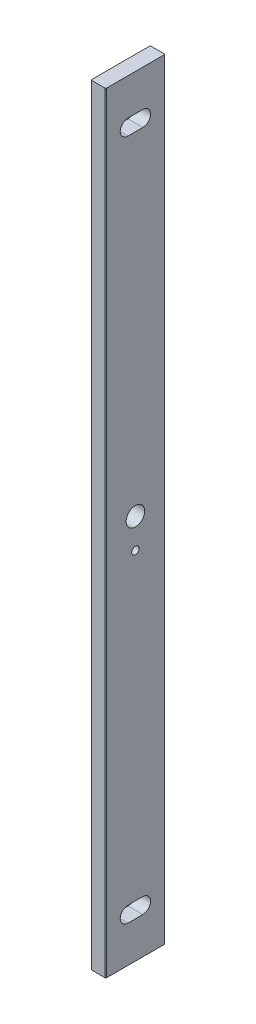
ISO-10303-21;
HEADER;
FILE_DESCRIPTION(('STEP AP214'),'2;1');
FILE_NAME('part.step','',(''),(''),'','','');
FILE_SCHEMA(('AUTOMOTIVE_DESIGN { 1 0 10303 214 1 1 1 1 }'));
ENDSEC;
DATA;
#1=APPLICATION_CONTEXT('core data for automotive mechanical design processes');
#2=APPLICATION_PROTOCOL_DEFINITION('international standard','automotive_design',2000,#1);
#3=PRODUCT_CONTEXT('',#1,'mechanical');
#4=PRODUCT('Part','Part','',(#3));
#5=PRODUCT_RELATED_PRODUCT_CATEGORY('part','',(#4));
#6=PRODUCT_DEFINITION_FORMATION('','',#4);
#7=PRODUCT_DEFINITION_CONTEXT('part definition',#1,'design');
#8=PRODUCT_DEFINITION('design','',#6,#7);
#9=PRODUCT_DEFINITION_SHAPE('','',#8);
#10=(LENGTH_UNIT() NAMED_UNIT(*) SI_UNIT(.MILLI.,.METRE.));
#11=(NAMED_UNIT(*) PLANE_ANGLE_UNIT() SI_UNIT($,.RADIAN.));
#12=(NAMED_UNIT(*) SI_UNIT($,.STERADIAN.) SOLID_ANGLE_UNIT());
#13=UNCERTAINTY_MEASURE_WITH_UNIT(LENGTH_MEASURE(1.E-05),#10,'distance_accuracy_value','');
#14=(GEOMETRIC_REPRESENTATION_CONTEXT(3) GLOBAL_UNCERTAINTY_ASSIGNED_CONTEXT((#13)) GLOBAL_UNIT_ASSIGNED_CONTEXT((#10,
#11,#12)) REPRESENTATION_CONTEXT('',''));
#15=CARTESIAN_POINT('',(0.,0.,0.));
#16=DIRECTION('',(0.,0.,1.));
#17=DIRECTION('',(1.,0.,0.));
#18=AXIS2_PLACEMENT_3D('',#15,#16,#17);
#19=CARTESIAN_POINT('',(5.,-260.,20.));
#20=DIRECTION('',(0.,0.,1.));
#21=DIRECTION('',(1.,0.,0.));
#22=AXIS2_PLACEMENT_3D('',#19,#20,#21);
#23=PLANE('',#22);
#24=DIRECTION('',(-1.,0.,0.));
#25=VECTOR('',#24,1.);
#26=CARTESIAN_POINT('',(5.,-260.,20.));
#27=LINE('',#26,#25);
#28=CARTESIAN_POINT('',(4.5,-260.,20.));
#29=VERTEX_POINT('',#28);
#30=CARTESIAN_POINT('',(-4.5,-260.,20.));
#31=VERTEX_POINT('',#30);
#32=EDGE_CURVE('E238',#29,#31,#27,.T.);
#33=ORIENTED_EDGE('',*,*,#32,.F.);
#34=DIRECTION('',(0.,1.,0.));
#35=VECTOR('',#34,1.);
#36=CARTESIAN_POINT('',(4.5,260.,20.));
#37=LINE('',#36,#35);
#38=CARTESIAN_POINT('',(4.5,260.,20.));
#39=VERTEX_POINT('',#38);
#40=EDGE_CURVE('E250',#29,#39,#37,.T.);
#41=ORIENTED_EDGE('',*,*,#40,.T.);
#42=DIRECTION('',(-1.,0.,0.));
#43=VECTOR('',#42,1.);
#44=CARTESIAN_POINT('',(5.,260.,20.));
#45=LINE('',#44,#43);
#46=CARTESIAN_POINT('',(-4.5,260.,20.));
#47=VERTEX_POINT('',#46);
#48=EDGE_CURVE('E233',#39,#47,#45,.T.);
#49=ORIENTED_EDGE('',*,*,#48,.T.);
#50=DIRECTION('',(0.,1.,0.));
#51=VECTOR('',#50,1.);
#52=CARTESIAN_POINT('',(-4.5,-260.,20.));
#53=LINE('',#52,#51);
#54=EDGE_CURVE('E241',#47,#31,#53,.F.);
#55=ORIENTED_EDGE('',*,*,#54,.T.);
#56=EDGE_LOOP('',(#33,#41,#49,#55));
#57=FACE_BOUND('',#56,.T.);
#58=ADVANCED_FACE('F32',(#57),#23,.T.);
#59=CARTESIAN_POINT('',(5.,-260.,-20.));
#60=DIRECTION('',(0.,-1.,0.));
#61=DIRECTION('',(0.,0.,-1.));
#62=AXIS2_PLACEMENT_3D('',#59,#60,#61);
#63=PLANE('',#62);
#64=DIRECTION('',(0.,0.,1.));
#65=VECTOR('',#64,1.);
#66=CARTESIAN_POINT('',(5.,-260.,-20.));
#67=LINE('',#66,#65);
#68=CARTESIAN_POINT('',(5.,-260.,-19.5));
#69=VERTEX_POINT('',#68);
#70=CARTESIAN_POINT('',(5.,-260.,19.5));
#71=VERTEX_POINT('',#70);
#72=EDGE_CURVE('E229',#69,#71,#67,.T.);
#73=ORIENTED_EDGE('',*,*,#72,.T.);
#74=CARTESIAN_POINT('',(4.5,-260.,19.5));
#75=DIRECTION('',(0.,-1.,0.));
#76=DIRECTION('',(0.,0.,-1.));
#77=AXIS2_PLACEMENT_3D('',#74,#75,#76);
#78=CIRCLE('',#77,0.5);
#79=EDGE_CURVE('E269',#71,#29,#78,.T.);
#80=ORIENTED_EDGE('',*,*,#79,.T.);
#81=ORIENTED_EDGE('',*,*,#32,.T.);
#82=CARTESIAN_POINT('',(-4.5,-260.,19.5));
#83=DIRECTION('',(0.,-1.,0.));
#84=DIRECTION('',(0.,0.,-1.));
#85=AXIS2_PLACEMENT_3D('',#82,#83,#84);
#86=CIRCLE('',#85,0.5);
#87=CARTESIAN_POINT('',(-5.,-260.,19.5));
#88=VERTEX_POINT('',#87);
#89=EDGE_CURVE('E266',#31,#88,#86,.T.);
#90=ORIENTED_EDGE('',*,*,#89,.T.);
#91=DIRECTION('',(0.,0.,1.));
#92=VECTOR('',#91,1.);
#93=CARTESIAN_POINT('',(-5.,-260.,-20.));
#94=LINE('',#93,#92);
#95=CARTESIAN_POINT('',(-5.,-260.,-19.5));
#96=VERTEX_POINT('',#95);
#97=EDGE_CURVE('E230',#96,#88,#94,.T.);
#98=ORIENTED_EDGE('',*,*,#97,.F.);
#99=CARTESIAN_POINT('',(-4.5,-260.,-19.5));
#100=DIRECTION('',(0.,-1.,0.));
#101=DIRECTION('',(0.,0.,-1.));
#102=AXIS2_PLACEMENT_3D('',#99,#100,#101);
#103=CIRCLE('',#102,0.5);
#104=CARTESIAN_POINT('',(-4.5,-260.,-20.));
#105=VERTEX_POINT('',#104);
#106=EDGE_CURVE('E47',#96,#105,#103,.T.);
#107=ORIENTED_EDGE('',*,*,#106,.T.);
#108=DIRECTION('',(-1.,0.,0.));
#109=VECTOR('',#108,1.);
#110=CARTESIAN_POINT('',(5.,-260.,-20.));
#111=LINE('',#110,#109);
#112=CARTESIAN_POINT('',(4.5,-260.,-20.));
#113=VERTEX_POINT('',#112);
#114=EDGE_CURVE('E242',#113,#105,#111,.T.);
#115=ORIENTED_EDGE('',*,*,#114,.F.);
#116=CARTESIAN_POINT('',(4.5,-260.,-19.5));
#117=DIRECTION('',(0.,-1.,0.));
#118=DIRECTION('',(0.,0.,-1.));
#119=AXIS2_PLACEMENT_3D('',#116,#117,#118);
#120=CIRCLE('',#119,0.5);
#121=EDGE_CURVE('E55',#113,#69,#120,.T.);
#122=ORIENTED_EDGE('',*,*,#121,.T.);
#123=EDGE_LOOP('',(#73,#80,#81,#90,#98,#107,#115,#122));
#124=FACE_BOUND('',#123,.T.);
#125=ADVANCED_FACE('F281',(#124),#63,.T.);
#126=CARTESIAN_POINT('',(5.,260.,-20.));
#127=DIRECTION('',(0.,0.,-1.));
#128=DIRECTION('',(-1.,0.,0.));
#129=AXIS2_PLACEMENT_3D('',#126,#127,#128);
#130=PLANE('',#129);
#131=DIRECTION('',(-1.,0.,0.));
#132=VECTOR('',#131,1.);
#133=CARTESIAN_POINT('',(5.,260.,-20.));
#134=LINE('',#133,#132);
#135=CARTESIAN_POINT('',(4.5,260.,-20.));
#136=VERTEX_POINT('',#135);
#137=CARTESIAN_POINT('',(-4.5,260.,-20.));
#138=VERTEX_POINT('',#137);
#139=EDGE_CURVE('E244',#136,#138,#134,.T.);
#140=ORIENTED_EDGE('',*,*,#139,.F.);
#141=DIRECTION('',(0.,-1.,0.));
#142=VECTOR('',#141,1.);
#143=CARTESIAN_POINT('',(4.5,-260.,-20.));
#144=LINE('',#143,#142);
#145=EDGE_CURVE('E273',#136,#113,#144,.T.);
#146=ORIENTED_EDGE('',*,*,#145,.T.);
#147=ORIENTED_EDGE('',*,*,#114,.T.);
#148=DIRECTION('',(0.,-1.,0.));
#149=VECTOR('',#148,1.);
#150=CARTESIAN_POINT('',(-4.5,260.,-20.));
#151=LINE('',#150,#149);
#152=EDGE_CURVE('E271',#105,#138,#151,.F.);
#153=ORIENTED_EDGE('',*,*,#152,.T.);
#154=EDGE_LOOP('',(#140,#146,#147,#153));
#155=FACE_BOUND('',#154,.T.);
#156=ADVANCED_FACE('F293',(#155),#130,.T.);
#157=CARTESIAN_POINT('',(5.,260.,20.));
#158=DIRECTION('',(0.,1.,0.));
#159=DIRECTION('',(0.,0.,1.));
#160=AXIS2_PLACEMENT_3D('',#157,#158,#159);
#161=PLANE('',#160);
#162=ORIENTED_EDGE('',*,*,#48,.F.);
#163=CARTESIAN_POINT('',(4.5,260.,19.5));
#164=DIRECTION('',(0.,1.,0.));
#165=DIRECTION('',(0.,0.,1.));
#166=AXIS2_PLACEMENT_3D('',#163,#164,#165);
#167=CIRCLE('',#166,0.5);
#168=CARTESIAN_POINT('',(5.,260.,19.5));
#169=VERTEX_POINT('',#168);
#170=EDGE_CURVE('E259',#39,#169,#167,.T.);
#171=ORIENTED_EDGE('',*,*,#170,.T.);
#172=DIRECTION('',(0.,0.,-1.));
#173=VECTOR('',#172,1.);
#174=CARTESIAN_POINT('',(5.,260.,20.));
#175=LINE('',#174,#173);
#176=CARTESIAN_POINT('',(5.,260.,-19.5));
#177=VERTEX_POINT('',#176);
#178=EDGE_CURVE('E226',#169,#177,#175,.T.);
#179=ORIENTED_EDGE('',*,*,#178,.T.);
#180=CARTESIAN_POINT('',(4.5,260.,-19.5));
#181=DIRECTION('',(0.,1.,0.));
#182=DIRECTION('',(0.,0.,1.));
#183=AXIS2_PLACEMENT_3D('',#180,#181,#182);
#184=CIRCLE('',#183,0.5);
#185=EDGE_CURVE('E257',#177,#136,#184,.T.);
#186=ORIENTED_EDGE('',*,*,#185,.T.);
#187=ORIENTED_EDGE('',*,*,#139,.T.);
#188=CARTESIAN_POINT('',(-4.5,260.,-19.5));
#189=DIRECTION('',(0.,1.,0.));
#190=DIRECTION('',(0.,0.,1.));
#191=AXIS2_PLACEMENT_3D('',#188,#189,#190);
#192=CIRCLE('',#191,0.5);
#193=CARTESIAN_POINT('',(-5.,260.,-19.5));
#194=VERTEX_POINT('',#193);
#195=EDGE_CURVE('E253',#138,#194,#192,.T.);
#196=ORIENTED_EDGE('',*,*,#195,.T.);
#197=DIRECTION('',(0.,0.,-1.));
#198=VECTOR('',#197,1.);
#199=CARTESIAN_POINT('',(-5.,260.,20.));
#200=LINE('',#199,#198);
#201=CARTESIAN_POINT('',(-5.,260.,19.5));
#202=VERTEX_POINT('',#201);
#203=EDGE_CURVE('E219',#202,#194,#200,.T.);
#204=ORIENTED_EDGE('',*,*,#203,.F.);
#205=CARTESIAN_POINT('',(-4.5,260.,19.5));
#206=DIRECTION('',(0.,1.,0.));
#207=DIRECTION('',(0.,0.,1.));
#208=AXIS2_PLACEMENT_3D('',#205,#206,#207);
#209=CIRCLE('',#208,0.5);
#210=EDGE_CURVE('E255',#202,#47,#209,.T.);
#211=ORIENTED_EDGE('',*,*,#210,.T.);
#212=EDGE_LOOP('',(#162,#171,#179,#186,#187,#196,#204,#211));
#213=FACE_BOUND('',#212,.T.);
#214=ADVANCED_FACE('F289',(#213),#161,.T.);
#215=CARTESIAN_POINT('',(5.,0.,0.));
#216=DIRECTION('',(-1.,0.,0.));
#217=DIRECTION('',(0.,0.,1.));
#218=AXIS2_PLACEMENT_3D('',#215,#216,#217);
#219=PLANE('',#218);
#220=CARTESIAN_POINT('',(5.,0.,0.));
#221=DIRECTION('',(1.,0.,0.));
#222=DIRECTION('',(0.,0.,-1.));
#223=AXIS2_PLACEMENT_3D('',#220,#221,#222);
#224=CIRCLE('',#223,6.24999999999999);
#225=CARTESIAN_POINT('',(5.,0.,-6.24999999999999));
#226=VERTEX_POINT('',#225);
#227=EDGE_CURVE('E503',#226,#226,#224,.T.);
#228=ORIENTED_EDGE('',*,*,#227,.F.);
#229=EDGE_LOOP('',(#228));
#230=FACE_BOUND('',#229,.T.);
#231=CARTESIAN_POINT('',(5.,-20.,0.));
#232=DIRECTION('',(1.,0.,0.));
#233=DIRECTION('',(0.,0.,-1.));
#234=AXIS2_PLACEMENT_3D('',#231,#232,#233);
#235=CIRCLE('',#234,2.49999999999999);
#236=CARTESIAN_POINT('',(5.,-20.,-2.49999999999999));
#237=VERTEX_POINT('',#236);
#238=EDGE_CURVE('E499',#237,#237,#235,.T.);
#239=ORIENTED_EDGE('',*,*,#238,.F.);
#240=EDGE_LOOP('',(#239));
#241=FACE_BOUND('',#240,.T.);
#242=DIRECTION('',(0.,0.,-1.));
#243=VECTOR('',#242,1.);
#244=CARTESIAN_POINT('',(5.,-235.25,5.));
#245=LINE('',#244,#243);
#246=CARTESIAN_POINT('',(5.,-235.25,5.));
#247=VERTEX_POINT('',#246);
#248=CARTESIAN_POINT('',(5.,-235.25,-5.));
#249=VERTEX_POINT('',#248);
#250=EDGE_CURVE('E184',#247,#249,#245,.T.);
#251=ORIENTED_EDGE('',*,*,#250,.F.);
#252=CARTESIAN_POINT('',(5.,-230.,5.));
#253=DIRECTION('',(1.,0.,0.));
#254=DIRECTION('',(0.,0.,-1.));
#255=AXIS2_PLACEMENT_3D('',#252,#253,#254);
#256=CIRCLE('',#255,5.25);
#257=CARTESIAN_POINT('',(5.,-224.75,5.));
#258=VERTEX_POINT('',#257);
#259=EDGE_CURVE('E154',#258,#247,#256,.T.);
#260=ORIENTED_EDGE('',*,*,#259,.F.);
#261=DIRECTION('',(0.,0.,1.));
#262=VECTOR('',#261,1.);
#263=CARTESIAN_POINT('',(5.,-224.75,-5.));
#264=LINE('',#263,#262);
#265=CARTESIAN_POINT('',(5.,-224.75,-5.));
#266=VERTEX_POINT('',#265);
#267=EDGE_CURVE('E172',#266,#258,#264,.T.);
#268=ORIENTED_EDGE('',*,*,#267,.F.);
#269=CARTESIAN_POINT('',(5.,-230.,-5.));
#270=DIRECTION('',(1.,0.,0.));
#271=DIRECTION('',(0.,0.,-1.));
#272=AXIS2_PLACEMENT_3D('',#269,#270,#271);
#273=CIRCLE('',#272,5.25);
#274=EDGE_CURVE('E175',#249,#266,#273,.T.);
#275=ORIENTED_EDGE('',*,*,#274,.F.);
#276=EDGE_LOOP('',(#251,#260,#268,#275));
#277=FACE_BOUND('',#276,.T.);
#278=DIRECTION('',(0.,0.,1.));
#279=VECTOR('',#278,1.);
#280=CARTESIAN_POINT('',(5.,224.75,-5.));
#281=LINE('',#280,#279);
#282=CARTESIAN_POINT('',(5.,224.75,-5.));
#283=VERTEX_POINT('',#282);
#284=CARTESIAN_POINT('',(5.,224.75,5.));
#285=VERTEX_POINT('',#284);
#286=EDGE_CURVE('E204',#283,#285,#281,.T.);
#287=ORIENTED_EDGE('',*,*,#286,.T.);
#288=CARTESIAN_POINT('',(5.,230.,5.));
#289=DIRECTION('',(-1.,0.,0.));
#290=DIRECTION('',(0.,0.,1.));
#291=AXIS2_PLACEMENT_3D('',#288,#289,#290);
#292=CIRCLE('',#291,5.25);
#293=CARTESIAN_POINT('',(5.,235.25,5.));
#294=VERTEX_POINT('',#293);
#295=EDGE_CURVE('E194',#285,#294,#292,.T.);
#296=ORIENTED_EDGE('',*,*,#295,.T.);
#297=DIRECTION('',(0.,0.,-1.));
#298=VECTOR('',#297,1.);
#299=CARTESIAN_POINT('',(5.,235.25,5.));
#300=LINE('',#299,#298);
#301=CARTESIAN_POINT('',(5.,235.25,-5.));
#302=VERTEX_POINT('',#301);
#303=EDGE_CURVE('E197',#294,#302,#300,.T.);
#304=ORIENTED_EDGE('',*,*,#303,.T.);
#305=CARTESIAN_POINT('',(5.,230.,-5.));
#306=DIRECTION('',(-1.,0.,0.));
#307=DIRECTION('',(0.,0.,1.));
#308=AXIS2_PLACEMENT_3D('',#305,#306,#307);
#309=CIRCLE('',#308,5.25);
#310=EDGE_CURVE('E201',#302,#283,#309,.T.);
#311=ORIENTED_EDGE('',*,*,#310,.T.);
#312=EDGE_LOOP('',(#287,#296,#304,#311));
#313=FACE_BOUND('',#312,.T.);
#314=ORIENTED_EDGE('',*,*,#178,.F.);
#315=DIRECTION('',(0.,1.,0.));
#316=VECTOR('',#315,1.);
#317=CARTESIAN_POINT('',(5.,-260.,19.5));
#318=LINE('',#317,#316);
#319=EDGE_CURVE('E263',#169,#71,#318,.F.);
#320=ORIENTED_EDGE('',*,*,#319,.T.);
#321=ORIENTED_EDGE('',*,*,#72,.F.);
#322=DIRECTION('',(0.,-1.,0.));
#323=VECTOR('',#322,1.);
#324=CARTESIAN_POINT('',(5.,260.,-19.5));
#325=LINE('',#324,#323);
#326=EDGE_CURVE('E261',#69,#177,#325,.F.);
#327=ORIENTED_EDGE('',*,*,#326,.T.);
#328=EDGE_LOOP('',(#314,#320,#321,#327));
#329=FACE_BOUND('',#328,.T.);
#330=ADVANCED_FACE('F298',(#230,#241,#277,#313,#329),#219,.F.);
#331=CARTESIAN_POINT('',(-5.,0.,0.));
#332=DIRECTION('',(-1.,0.,0.));
#333=DIRECTION('',(0.,0.,1.));
#334=AXIS2_PLACEMENT_3D('',#331,#332,#333);
#335=PLANE('',#334);
#336=CARTESIAN_POINT('',(-4.99999999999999,0.,0.));
#337=DIRECTION('',(1.,0.,0.));
#338=DIRECTION('',(0.,0.,-1.));
#339=AXIS2_PLACEMENT_3D('',#336,#337,#338);
#340=CIRCLE('',#339,6.24999999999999);
#341=CARTESIAN_POINT('',(-4.99999999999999,0.,-6.24999999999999));
#342=VERTEX_POINT('',#341);
#343=EDGE_CURVE('E501',#342,#342,#340,.T.);
#344=ORIENTED_EDGE('',*,*,#343,.T.);
#345=EDGE_LOOP('',(#344));
#346=FACE_BOUND('',#345,.T.);
#347=CARTESIAN_POINT('',(-4.99999999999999,-20.,0.));
#348=DIRECTION('',(1.,0.,0.));
#349=DIRECTION('',(0.,0.,-1.));
#350=AXIS2_PLACEMENT_3D('',#347,#348,#349);
#351=CIRCLE('',#350,2.49999999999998);
#352=CARTESIAN_POINT('',(-4.99999999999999,-20.,-2.49999999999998));
#353=VERTEX_POINT('',#352);
#354=EDGE_CURVE('E178',#353,#353,#351,.T.);
#355=ORIENTED_EDGE('',*,*,#354,.T.);
#356=EDGE_LOOP('',(#355));
#357=FACE_BOUND('',#356,.T.);
#358=CARTESIAN_POINT('',(-5.,-230.,5.));
#359=DIRECTION('',(1.,0.,0.));
#360=DIRECTION('',(0.,0.,-1.));
#361=AXIS2_PLACEMENT_3D('',#358,#359,#360);
#362=CIRCLE('',#361,5.25);
#363=CARTESIAN_POINT('',(-5.,-224.75,5.));
#364=VERTEX_POINT('',#363);
#365=CARTESIAN_POINT('',(-5.,-235.25,5.));
#366=VERTEX_POINT('',#365);
#367=EDGE_CURVE('E151',#364,#366,#362,.T.);
#368=ORIENTED_EDGE('',*,*,#367,.T.);
#369=DIRECTION('',(0.,0.,-1.));
#370=VECTOR('',#369,1.);
#371=CARTESIAN_POINT('',(-5.,-235.25,5.));
#372=LINE('',#371,#370);
#373=CARTESIAN_POINT('',(-5.,-235.25,-5.));
#374=VERTEX_POINT('',#373);
#375=EDGE_CURVE('E163',#366,#374,#372,.T.);
#376=ORIENTED_EDGE('',*,*,#375,.T.);
#377=CARTESIAN_POINT('',(-5.,-230.,-5.));
#378=DIRECTION('',(1.,0.,0.));
#379=DIRECTION('',(0.,0.,-1.));
#380=AXIS2_PLACEMENT_3D('',#377,#378,#379);
#381=CIRCLE('',#380,5.25);
#382=CARTESIAN_POINT('',(-5.,-224.75,-5.));
#383=VERTEX_POINT('',#382);
#384=EDGE_CURVE('E167',#374,#383,#381,.T.);
#385=ORIENTED_EDGE('',*,*,#384,.T.);
#386=DIRECTION('',(0.,0.,1.));
#387=VECTOR('',#386,1.);
#388=CARTESIAN_POINT('',(-5.,-224.75,-5.));
#389=LINE('',#388,#387);
#390=EDGE_CURVE('E159',#383,#364,#389,.T.);
#391=ORIENTED_EDGE('',*,*,#390,.T.);
#392=EDGE_LOOP('',(#368,#376,#385,#391));
#393=FACE_BOUND('',#392,.T.);
#394=CARTESIAN_POINT('',(-5.,230.,5.));
#395=DIRECTION('',(-1.,0.,0.));
#396=DIRECTION('',(0.,0.,1.));
#397=AXIS2_PLACEMENT_3D('',#394,#395,#396);
#398=CIRCLE('',#397,5.25);
#399=CARTESIAN_POINT('',(-5.,224.75,5.));
#400=VERTEX_POINT('',#399);
#401=CARTESIAN_POINT('',(-5.,235.25,5.));
#402=VERTEX_POINT('',#401);
#403=EDGE_CURVE('E190',#400,#402,#398,.T.);
#404=ORIENTED_EDGE('',*,*,#403,.F.);
#405=DIRECTION('',(0.,0.,1.));
#406=VECTOR('',#405,1.);
#407=CARTESIAN_POINT('',(-5.,224.75,-5.));
#408=LINE('',#407,#406);
#409=CARTESIAN_POINT('',(-5.,224.75,-5.));
#410=VERTEX_POINT('',#409);
#411=EDGE_CURVE('E198',#410,#400,#408,.T.);
#412=ORIENTED_EDGE('',*,*,#411,.F.);
#413=CARTESIAN_POINT('',(-5.,230.,-5.));
#414=DIRECTION('',(-1.,0.,0.));
#415=DIRECTION('',(0.,0.,1.));
#416=AXIS2_PLACEMENT_3D('',#413,#414,#415);
#417=CIRCLE('',#416,5.25);
#418=CARTESIAN_POINT('',(-5.,235.25,-5.));
#419=VERTEX_POINT('',#418);
#420=EDGE_CURVE('E212',#419,#410,#417,.T.);
#421=ORIENTED_EDGE('',*,*,#420,.F.);
#422=DIRECTION('',(0.,0.,-1.));
#423=VECTOR('',#422,1.);
#424=CARTESIAN_POINT('',(-5.,235.25,5.));
#425=LINE('',#424,#423);
#426=EDGE_CURVE('E209',#402,#419,#425,.T.);
#427=ORIENTED_EDGE('',*,*,#426,.F.);
#428=EDGE_LOOP('',(#404,#412,#421,#427));
#429=FACE_BOUND('',#428,.T.);
#430=ORIENTED_EDGE('',*,*,#97,.T.);
#431=DIRECTION('',(0.,1.,0.));
#432=VECTOR('',#431,1.);
#433=CARTESIAN_POINT('',(-5.,0.,19.5));
#434=LINE('',#433,#432);
#435=EDGE_CURVE('E11',#88,#202,#434,.T.);
#436=ORIENTED_EDGE('',*,*,#435,.T.);
#437=ORIENTED_EDGE('',*,*,#203,.T.);
#438=DIRECTION('',(0.,-1.,0.));
#439=VECTOR('',#438,1.);
#440=CARTESIAN_POINT('',(-5.,0.,-19.5));
#441=LINE('',#440,#439);
#442=EDGE_CURVE('E40',#194,#96,#441,.T.);
#443=ORIENTED_EDGE('',*,*,#442,.T.);
#444=EDGE_LOOP('',(#430,#436,#437,#443));
#445=FACE_BOUND('',#444,.T.);
#446=ADVANCED_FACE('F169',(#346,#357,#393,#429,#445),#335,.T.);
#447=CARTESIAN_POINT('',(5.,230.,5.));
#448=DIRECTION('',(-1.,0.,0.));
#449=DIRECTION('',(0.,0.,1.));
#450=AXIS2_PLACEMENT_3D('',#447,#448,#449);
#451=CYLINDRICAL_SURFACE('',#450,5.25);
#452=ORIENTED_EDGE('',*,*,#403,.T.);
#453=DIRECTION('',(-1.,0.,0.));
#454=VECTOR('',#453,1.);
#455=CARTESIAN_POINT('',(5.,235.25,5.));
#456=LINE('',#455,#454);
#457=EDGE_CURVE('E207',#294,#402,#456,.T.);
#458=ORIENTED_EDGE('',*,*,#457,.F.);
#459=ORIENTED_EDGE('',*,*,#295,.F.);
#460=DIRECTION('',(-1.,0.,0.));
#461=VECTOR('',#460,1.);
#462=CARTESIAN_POINT('',(5.,224.75,5.));
#463=LINE('',#462,#461);
#464=EDGE_CURVE('E217',#285,#400,#463,.T.);
#465=ORIENTED_EDGE('',*,*,#464,.T.);
#466=EDGE_LOOP('',(#452,#458,#459,#465));
#467=FACE_BOUND('',#466,.T.);
#468=ADVANCED_FACE('F352',(#467),#451,.F.);
#469=CARTESIAN_POINT('',(5.,224.75,-5.));
#470=DIRECTION('',(0.,-1.,0.));
#471=DIRECTION('',(0.,0.,-1.));
#472=AXIS2_PLACEMENT_3D('',#469,#470,#471);
#473=PLANE('',#472);
#474=ORIENTED_EDGE('',*,*,#411,.T.);
#475=ORIENTED_EDGE('',*,*,#464,.F.);
#476=ORIENTED_EDGE('',*,*,#286,.F.);
#477=DIRECTION('',(-1.,0.,0.));
#478=VECTOR('',#477,1.);
#479=CARTESIAN_POINT('',(5.,224.75,-5.));
#480=LINE('',#479,#478);
#481=EDGE_CURVE('E220',#283,#410,#480,.T.);
#482=ORIENTED_EDGE('',*,*,#481,.T.);
#483=EDGE_LOOP('',(#474,#475,#476,#482));
#484=FACE_BOUND('',#483,.T.);
#485=ADVANCED_FACE('F461',(#484),#473,.F.);
#486=CARTESIAN_POINT('',(5.,230.,-5.));
#487=DIRECTION('',(-1.,0.,0.));
#488=DIRECTION('',(0.,0.,1.));
#489=AXIS2_PLACEMENT_3D('',#486,#487,#488);
#490=CYLINDRICAL_SURFACE('',#489,5.25);
#491=ORIENTED_EDGE('',*,*,#420,.T.);
#492=ORIENTED_EDGE('',*,*,#481,.F.);
#493=ORIENTED_EDGE('',*,*,#310,.F.);
#494=DIRECTION('',(-1.,0.,0.));
#495=VECTOR('',#494,1.);
#496=CARTESIAN_POINT('',(5.,235.25,-5.));
#497=LINE('',#496,#495);
#498=EDGE_CURVE('E222',#302,#419,#497,.T.);
#499=ORIENTED_EDGE('',*,*,#498,.T.);
#500=EDGE_LOOP('',(#491,#492,#493,#499));
#501=FACE_BOUND('',#500,.T.);
#502=ADVANCED_FACE('F451',(#501),#490,.F.);
#503=CARTESIAN_POINT('',(5.,235.25,5.));
#504=DIRECTION('',(0.,1.,0.));
#505=DIRECTION('',(0.,0.,1.));
#506=AXIS2_PLACEMENT_3D('',#503,#504,#505);
#507=PLANE('',#506);
#508=ORIENTED_EDGE('',*,*,#426,.T.);
#509=ORIENTED_EDGE('',*,*,#498,.F.);
#510=ORIENTED_EDGE('',*,*,#303,.F.);
#511=ORIENTED_EDGE('',*,*,#457,.T.);
#512=EDGE_LOOP('',(#508,#509,#510,#511));
#513=FACE_BOUND('',#512,.T.);
#514=ADVANCED_FACE('F442',(#513),#507,.F.);
#515=CARTESIAN_POINT('',(-5.,-230.,5.));
#516=DIRECTION('',(1.,0.,0.));
#517=DIRECTION('',(0.,0.,-1.));
#518=AXIS2_PLACEMENT_3D('',#515,#516,#517);
#519=CYLINDRICAL_SURFACE('',#518,5.25);
#520=ORIENTED_EDGE('',*,*,#259,.T.);
#521=DIRECTION('',(1.,0.,0.));
#522=VECTOR('',#521,1.);
#523=CARTESIAN_POINT('',(-5.,-235.25,5.));
#524=LINE('',#523,#522);
#525=EDGE_CURVE('E147',#366,#247,#524,.T.);
#526=ORIENTED_EDGE('',*,*,#525,.F.);
#527=ORIENTED_EDGE('',*,*,#367,.F.);
#528=DIRECTION('',(1.,0.,0.));
#529=VECTOR('',#528,1.);
#530=CARTESIAN_POINT('',(-5.,-224.75,5.));
#531=LINE('',#530,#529);
#532=EDGE_CURVE('E188',#364,#258,#531,.T.);
#533=ORIENTED_EDGE('',*,*,#532,.T.);
#534=EDGE_LOOP('',(#520,#526,#527,#533));
#535=FACE_BOUND('',#534,.T.);
#536=ADVANCED_FACE('F149',(#535),#519,.F.);
#537=CARTESIAN_POINT('',(-5.,-224.75,-5.));
#538=DIRECTION('',(0.,1.,0.));
#539=DIRECTION('',(0.,0.,1.));
#540=AXIS2_PLACEMENT_3D('',#537,#538,#539);
#541=PLANE('',#540);
#542=ORIENTED_EDGE('',*,*,#267,.T.);
#543=ORIENTED_EDGE('',*,*,#532,.F.);
#544=ORIENTED_EDGE('',*,*,#390,.F.);
#545=DIRECTION('',(1.,0.,0.));
#546=VECTOR('',#545,1.);
#547=CARTESIAN_POINT('',(-5.,-224.75,-5.));
#548=LINE('',#547,#546);
#549=EDGE_CURVE('E191',#383,#266,#548,.T.);
#550=ORIENTED_EDGE('',*,*,#549,.T.);
#551=EDGE_LOOP('',(#542,#543,#544,#550));
#552=FACE_BOUND('',#551,.T.);
#553=ADVANCED_FACE('F423',(#552),#541,.F.);
#554=CARTESIAN_POINT('',(-5.,-230.,-5.));
#555=DIRECTION('',(1.,0.,0.));
#556=DIRECTION('',(0.,0.,-1.));
#557=AXIS2_PLACEMENT_3D('',#554,#555,#556);
#558=CYLINDRICAL_SURFACE('',#557,5.25);
#559=ORIENTED_EDGE('',*,*,#274,.T.);
#560=ORIENTED_EDGE('',*,*,#549,.F.);
#561=ORIENTED_EDGE('',*,*,#384,.F.);
#562=DIRECTION('',(1.,0.,0.));
#563=VECTOR('',#562,1.);
#564=CARTESIAN_POINT('',(-5.,-235.25,-5.));
#565=LINE('',#564,#563);
#566=EDGE_CURVE('E158',#374,#249,#565,.T.);
#567=ORIENTED_EDGE('',*,*,#566,.T.);
#568=EDGE_LOOP('',(#559,#560,#561,#567));
#569=FACE_BOUND('',#568,.T.);
#570=ADVANCED_FACE('F414',(#569),#558,.F.);
#571=CARTESIAN_POINT('',(-5.,-235.25,5.));
#572=DIRECTION('',(0.,-1.,0.));
#573=DIRECTION('',(0.,0.,-1.));
#574=AXIS2_PLACEMENT_3D('',#571,#572,#573);
#575=PLANE('',#574);
#576=ORIENTED_EDGE('',*,*,#250,.T.);
#577=ORIENTED_EDGE('',*,*,#566,.F.);
#578=ORIENTED_EDGE('',*,*,#375,.F.);
#579=ORIENTED_EDGE('',*,*,#525,.T.);
#580=EDGE_LOOP('',(#576,#577,#578,#579));
#581=FACE_BOUND('',#580,.T.);
#582=ADVANCED_FACE('F164',(#581),#575,.F.);
#583=CARTESIAN_POINT('',(5.,-20.,0.));
#584=DIRECTION('',(1.,0.,0.));
#585=DIRECTION('',(0.,0.,-1.));
#586=AXIS2_PLACEMENT_3D('',#583,#584,#585);
#587=CYLINDRICAL_SURFACE('',#586,2.49999999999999);
#588=ORIENTED_EDGE('',*,*,#354,.F.);
#589=EDGE_LOOP('',(#588));
#590=FACE_BOUND('',#589,.T.);
#591=ORIENTED_EDGE('',*,*,#238,.T.);
#592=EDGE_LOOP('',(#591));
#593=FACE_BOUND('',#592,.T.);
#594=ADVANCED_FACE('F395',(#590,#593),#587,.F.);
#595=CARTESIAN_POINT('',(5.,0.,0.));
#596=DIRECTION('',(1.,0.,0.));
#597=DIRECTION('',(0.,0.,-1.));
#598=AXIS2_PLACEMENT_3D('',#595,#596,#597);
#599=CYLINDRICAL_SURFACE('',#598,6.24999999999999);
#600=ORIENTED_EDGE('',*,*,#343,.F.);
#601=EDGE_LOOP('',(#600));
#602=FACE_BOUND('',#601,.T.);
#603=ORIENTED_EDGE('',*,*,#227,.T.);
#604=EDGE_LOOP('',(#603));
#605=FACE_BOUND('',#604,.T.);
#606=ADVANCED_FACE('F317',(#602,#605),#599,.F.);
#607=CARTESIAN_POINT('',(4.5,-260.,19.5));
#608=DIRECTION('',(0.,-1.,0.));
#609=DIRECTION('',(0.,0.,-1.));
#610=AXIS2_PLACEMENT_3D('',#607,#608,#609);
#611=CYLINDRICAL_SURFACE('',#610,0.5);
#612=ORIENTED_EDGE('',*,*,#79,.F.);
#613=ORIENTED_EDGE('',*,*,#319,.F.);
#614=ORIENTED_EDGE('',*,*,#170,.F.);
#615=ORIENTED_EDGE('',*,*,#40,.F.);
#616=EDGE_LOOP('',(#612,#613,#614,#615));
#617=FACE_BOUND('',#616,.T.);
#618=ADVANCED_FACE('F303',(#617),#611,.T.);
#619=CARTESIAN_POINT('',(4.5,260.,-19.5));
#620=DIRECTION('',(0.,1.,0.));
#621=DIRECTION('',(0.,0.,1.));
#622=AXIS2_PLACEMENT_3D('',#619,#620,#621);
#623=CYLINDRICAL_SURFACE('',#622,0.5);
#624=ORIENTED_EDGE('',*,*,#185,.F.);
#625=ORIENTED_EDGE('',*,*,#326,.F.);
#626=ORIENTED_EDGE('',*,*,#121,.F.);
#627=ORIENTED_EDGE('',*,*,#145,.F.);
#628=EDGE_LOOP('',(#624,#625,#626,#627));
#629=FACE_BOUND('',#628,.T.);
#630=ADVANCED_FACE('F301',(#629),#623,.T.);
#631=CARTESIAN_POINT('',(-4.5,0.,19.5));
#632=DIRECTION('',(0.,1.,0.));
#633=DIRECTION('',(0.,0.,1.));
#634=AXIS2_PLACEMENT_3D('',#631,#632,#633);
#635=CYLINDRICAL_SURFACE('',#634,0.5);
#636=ORIENTED_EDGE('',*,*,#89,.F.);
#637=ORIENTED_EDGE('',*,*,#54,.F.);
#638=ORIENTED_EDGE('',*,*,#210,.F.);
#639=ORIENTED_EDGE('',*,*,#435,.F.);
#640=EDGE_LOOP('',(#636,#637,#638,#639));
#641=FACE_BOUND('',#640,.T.);
#642=ADVANCED_FACE('F286',(#641),#635,.T.);
#643=CARTESIAN_POINT('',(-4.5,0.,-19.5));
#644=DIRECTION('',(0.,-1.,0.));
#645=DIRECTION('',(0.,0.,-1.));
#646=AXIS2_PLACEMENT_3D('',#643,#644,#645);
#647=CYLINDRICAL_SURFACE('',#646,0.5);
#648=ORIENTED_EDGE('',*,*,#195,.F.);
#649=ORIENTED_EDGE('',*,*,#152,.F.);
#650=ORIENTED_EDGE('',*,*,#106,.F.);
#651=ORIENTED_EDGE('',*,*,#442,.F.);
#652=EDGE_LOOP('',(#648,#649,#650,#651));
#653=FACE_BOUND('',#652,.T.);
#654=ADVANCED_FACE('F34',(#653),#647,.T.);
#655=CLOSED_SHELL('',(#58,#125,#156,#214,#330,#446,#468,#485,#502,#514,#536,#553,#570,#582,#594,
#606,#618,#630,#642,#654));
#656=MANIFOLD_SOLID_BREP('B2',#655);
#657=ADVANCED_BREP_SHAPE_REPRESENTATION('',(#18,#656),#14);
#658=SHAPE_DEFINITION_REPRESENTATION(#9,#657);
ENDSEC;
END-ISO-10303-21;
